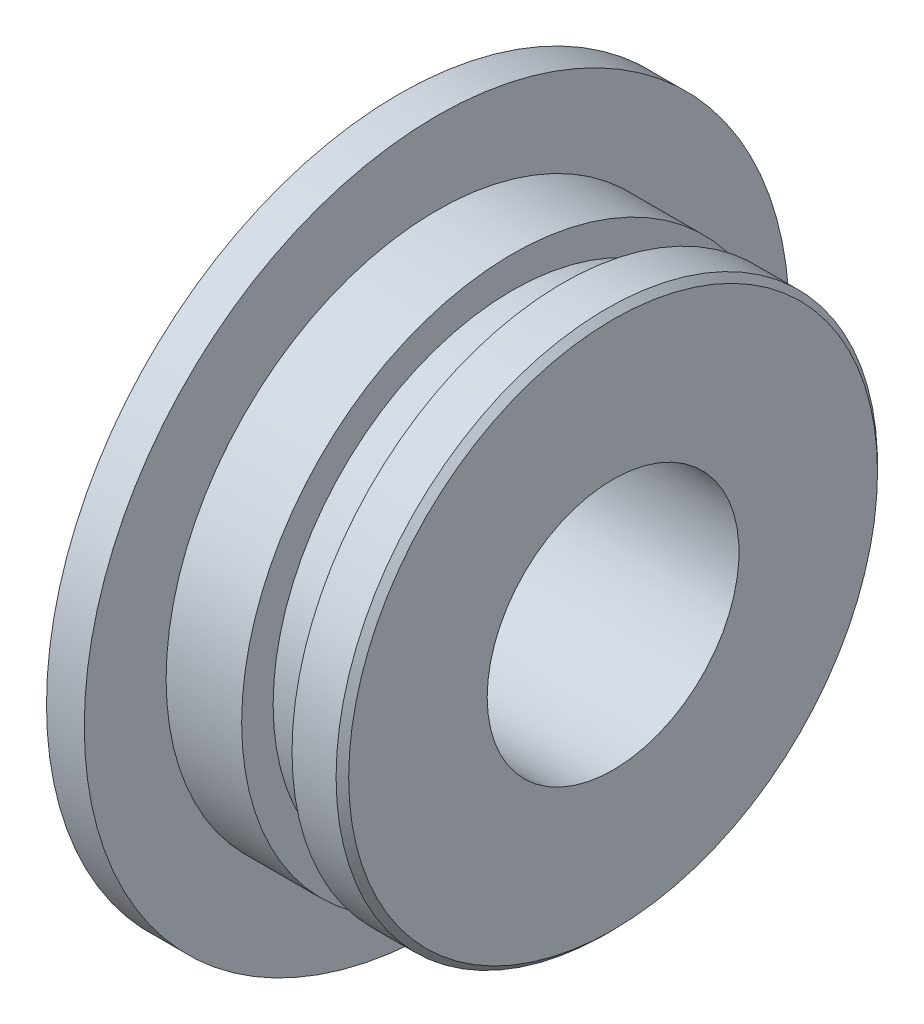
from build123d import *

# Parameters (mm, degrees)
CHAMFER1_SIZE = 0.25


with BuildPart() as part:
    # Sketch1 → Revolve1 (revolve)
    with BuildSketch(Plane.XY, mode=Mode.PRIVATE) as revolve1_sk:
        Polygon((0, 5), (0, 8.4), (2.4, 8.4), (2.4, 14), (3.9, 14), (3.9, 10.75), (6.9, 10.75), (6.9, 9.5), (8.9, 9.5), (8.9, 10.75), (10.9, 10.75), (10.9, 5), align=None)
    revolve(revolve1_sk.sketch.rotate(Axis((0, 0, 0), (1, 0, 0)), 90), axis=Axis((0, 0, 0), (1, 0, 0)))

    # Chamfer1
    chamfer1_edges = [part.edges().sort_by_distance(p)[0] for p in [
        (10.9, 0, -10.75),
    ]]
    chamfer(chamfer1_edges, length=CHAMFER1_SIZE)


solid = part.part
